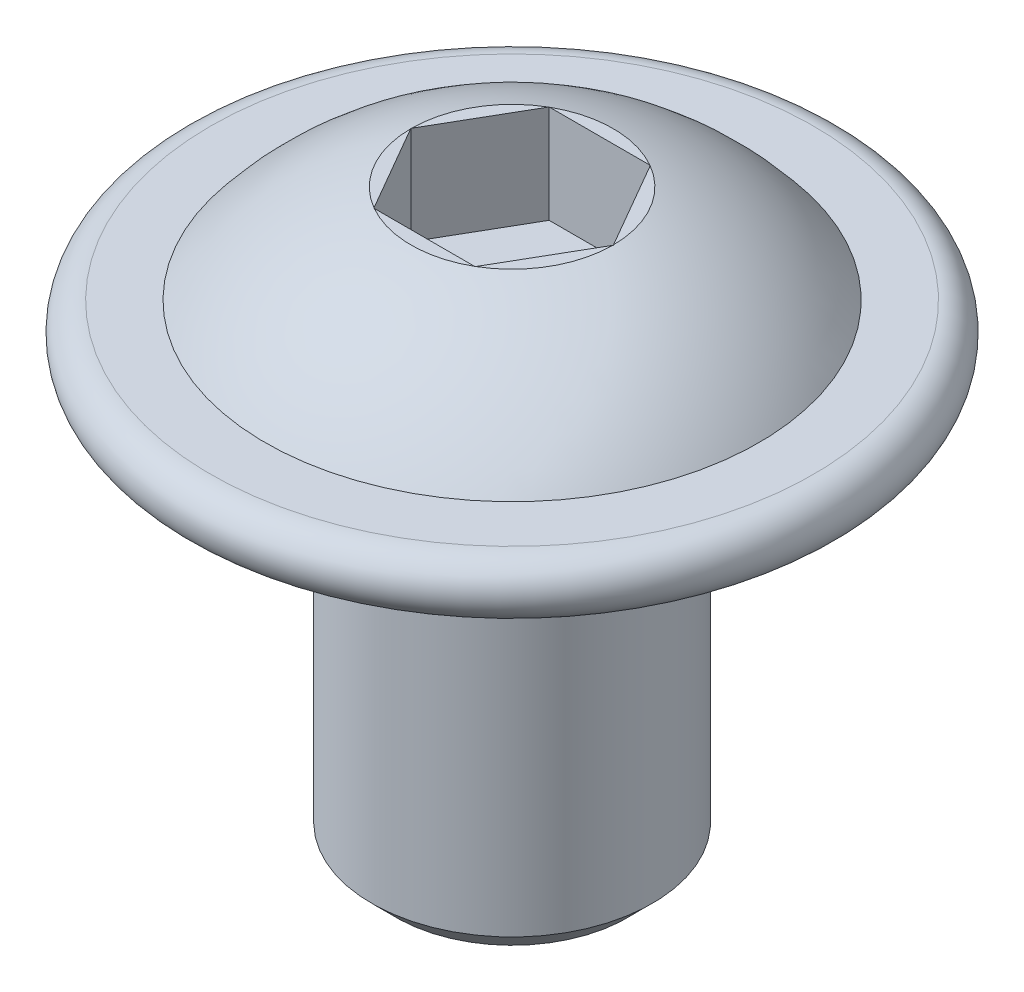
ISO-10303-21;
HEADER;
FILE_DESCRIPTION(('STEP AP214'),'2;1');
FILE_NAME('part.step','',(''),(''),'','','');
FILE_SCHEMA(('AUTOMOTIVE_DESIGN { 1 0 10303 214 1 1 1 1 }'));
ENDSEC;
DATA;
#1=APPLICATION_CONTEXT('core data for automotive mechanical design processes');
#2=APPLICATION_PROTOCOL_DEFINITION('international standard','automotive_design',2000,#1);
#3=PRODUCT_CONTEXT('',#1,'mechanical');
#4=PRODUCT('Part','Part','',(#3));
#5=PRODUCT_RELATED_PRODUCT_CATEGORY('part','',(#4));
#6=PRODUCT_DEFINITION_FORMATION('','',#4);
#7=PRODUCT_DEFINITION_CONTEXT('part definition',#1,'design');
#8=PRODUCT_DEFINITION('design','',#6,#7);
#9=PRODUCT_DEFINITION_SHAPE('','',#8);
#10=(LENGTH_UNIT() NAMED_UNIT(*) SI_UNIT(.MILLI.,.METRE.));
#11=(NAMED_UNIT(*) PLANE_ANGLE_UNIT() SI_UNIT($,.RADIAN.));
#12=(NAMED_UNIT(*) SI_UNIT($,.STERADIAN.) SOLID_ANGLE_UNIT());
#13=UNCERTAINTY_MEASURE_WITH_UNIT(LENGTH_MEASURE(1.E-05),#10,'distance_accuracy_value','');
#14=(GEOMETRIC_REPRESENTATION_CONTEXT(3) GLOBAL_UNCERTAINTY_ASSIGNED_CONTEXT((#13)) GLOBAL_UNIT_ASSIGNED_CONTEXT((#10,
#11,#12)) REPRESENTATION_CONTEXT('',''));
#15=CARTESIAN_POINT('',(0.,0.,0.));
#16=DIRECTION('',(0.,0.,1.));
#17=DIRECTION('',(1.,0.,0.));
#18=AXIS2_PLACEMENT_3D('',#15,#16,#17);
#19=CARTESIAN_POINT('',(0.,2.2,0.));
#20=DIRECTION('',(0.,-1.,0.));
#21=DIRECTION('',(1.,0.,0.));
#22=AXIS2_PLACEMENT_3D('',#19,#20,#21);
#23=PLANE('',#22);
#24=CARTESIAN_POINT('',(0.,2.2,0.));
#25=DIRECTION('',(0.,1.,0.));
#26=DIRECTION('',(-1.,0.,0.));
#27=AXIS2_PLACEMENT_3D('',#24,#25,#26);
#28=CIRCLE('',#27,1.44);
#29=CARTESIAN_POINT('',(1.43998804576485,2.2,-0.00586754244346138));
#30=VERTEX_POINT('',#29);
#31=CARTESIAN_POINT('',(0.725075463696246,2.2,-1.24413245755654));
#32=VERTEX_POINT('',#31);
#33=EDGE_CURVE('E295',#30,#32,#28,.T.);
#34=ORIENTED_EDGE('',*,*,#33,.T.);
#35=DIRECTION('',(0.5,0.,0.866025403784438));
#36=VECTOR('',#35,1.);
#37=CARTESIAN_POINT('',(1.08253175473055,2.2,-0.625));
#38=LINE('',#37,#36);
#39=EDGE_CURVE('E11',#32,#30,#38,.T.);
#40=ORIENTED_EDGE('',*,*,#39,.T.);
#41=EDGE_LOOP('',(#34,#40));
#42=FACE_BOUND('',#41,.T.);
#43=ADVANCED_FACE('F36',(#42),#23,.F.);
#44=CARTESIAN_POINT('',(0.714912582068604,2.2,-1.25));
#45=VERTEX_POINT('',#44);
#46=CARTESIAN_POINT('',(-0.714912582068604,2.2,-1.25));
#47=VERTEX_POINT('',#46);
#48=EDGE_CURVE('E292',#45,#47,#28,.T.);
#49=ORIENTED_EDGE('',*,*,#48,.T.);
#50=DIRECTION('',(1.,0.,0.));
#51=VECTOR('',#50,1.);
#52=CARTESIAN_POINT('',(0.,2.2,-1.25));
#53=LINE('',#52,#51);
#54=EDGE_CURVE('E44',#47,#45,#53,.T.);
#55=ORIENTED_EDGE('',*,*,#54,.T.);
#56=EDGE_LOOP('',(#49,#55));
#57=FACE_BOUND('',#56,.T.);
#58=ADVANCED_FACE('F291',(#57),#23,.F.);
#59=CARTESIAN_POINT('',(-0.725075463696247,2.2,-1.24413245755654));
#60=VERTEX_POINT('',#59);
#61=CARTESIAN_POINT('',(-1.43998804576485,2.2,-0.00586754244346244));
#62=VERTEX_POINT('',#61);
#63=EDGE_CURVE('E251',#60,#62,#28,.T.);
#64=ORIENTED_EDGE('',*,*,#63,.T.);
#65=DIRECTION('',(0.5,0.,-0.866025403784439));
#66=VECTOR('',#65,1.);
#67=CARTESIAN_POINT('',(-1.08253175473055,2.2,-0.625));
#68=LINE('',#67,#66);
#69=EDGE_CURVE('E285',#62,#60,#68,.T.);
#70=ORIENTED_EDGE('',*,*,#69,.T.);
#71=EDGE_LOOP('',(#64,#70));
#72=FACE_BOUND('',#71,.T.);
#73=ADVANCED_FACE('F301',(#72),#23,.F.);
#74=CARTESIAN_POINT('',(-1.43998804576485,2.2,0.00586754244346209));
#75=VERTEX_POINT('',#74);
#76=CARTESIAN_POINT('',(-0.725075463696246,2.2,1.24413245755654));
#77=VERTEX_POINT('',#76);
#78=EDGE_CURVE('E252',#75,#77,#28,.T.);
#79=ORIENTED_EDGE('',*,*,#78,.T.);
#80=DIRECTION('',(-0.5,0.,-0.866025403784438));
#81=VECTOR('',#80,1.);
#82=CARTESIAN_POINT('',(-1.08253175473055,2.2,0.625000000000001));
#83=LINE('',#82,#81);
#84=EDGE_CURVE('E282',#77,#75,#83,.T.);
#85=ORIENTED_EDGE('',*,*,#84,.T.);
#86=EDGE_LOOP('',(#79,#85));
#87=FACE_BOUND('',#86,.T.);
#88=ADVANCED_FACE('F318',(#87),#23,.F.);
#89=CARTESIAN_POINT('',(-0.714912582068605,2.2,1.25));
#90=VERTEX_POINT('',#89);
#91=CARTESIAN_POINT('',(0.714912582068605,2.2,1.25));
#92=VERTEX_POINT('',#91);
#93=EDGE_CURVE('E256',#90,#92,#28,.T.);
#94=ORIENTED_EDGE('',*,*,#93,.T.);
#95=DIRECTION('',(-1.,0.,0.));
#96=VECTOR('',#95,1.);
#97=CARTESIAN_POINT('',(0.,2.2,1.25));
#98=LINE('',#97,#96);
#99=EDGE_CURVE('E279',#92,#90,#98,.T.);
#100=ORIENTED_EDGE('',*,*,#99,.T.);
#101=EDGE_LOOP('',(#94,#100));
#102=FACE_BOUND('',#101,.T.);
#103=ADVANCED_FACE('F316',(#102),#23,.F.);
#104=CARTESIAN_POINT('',(1.65,-6.,0.));
#105=DIRECTION('',(0.,1.,0.));
#106=DIRECTION('',(-1.,0.,0.));
#107=AXIS2_PLACEMENT_3D('',#104,#105,#106);
#108=PLANE('',#107);
#109=CARTESIAN_POINT('',(0.,-6.,0.));
#110=DIRECTION('',(0.,1.,0.));
#111=DIRECTION('',(-1.,0.,0.));
#112=AXIS2_PLACEMENT_3D('',#109,#110,#111);
#113=CIRCLE('',#112,1.65);
#114=CARTESIAN_POINT('',(-1.65,-6.,0.));
#115=VERTEX_POINT('',#114);
#116=EDGE_CURVE('E274',#115,#115,#113,.T.);
#117=ORIENTED_EDGE('',*,*,#116,.F.);
#118=EDGE_LOOP('',(#117));
#119=FACE_BOUND('',#118,.T.);
#120=ADVANCED_FACE('F38',(#119),#108,.F.);
#121=CARTESIAN_POINT('',(0.,-6.,0.));
#122=DIRECTION('',(0.,1.,0.));
#123=DIRECTION('',(-1.,0.,0.));
#124=AXIS2_PLACEMENT_3D('',#121,#122,#123);
#125=CONICAL_SURFACE('',#124,1.65,0.785398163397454);
#126=CARTESIAN_POINT('',(0.,-5.65,0.));
#127=DIRECTION('',(0.,1.,0.));
#128=DIRECTION('',(-1.,0.,0.));
#129=AXIS2_PLACEMENT_3D('',#126,#127,#128);
#130=CIRCLE('',#129,2.);
#131=CARTESIAN_POINT('',(-2.,-5.65,0.));
#132=VERTEX_POINT('',#131);
#133=EDGE_CURVE('E271',#132,#132,#130,.T.);
#134=ORIENTED_EDGE('',*,*,#133,.F.);
#135=EDGE_LOOP('',(#134));
#136=FACE_BOUND('',#135,.T.);
#137=ORIENTED_EDGE('',*,*,#116,.T.);
#138=EDGE_LOOP('',(#137));
#139=FACE_BOUND('',#138,.T.);
#140=ADVANCED_FACE('F359',(#136,#139),#125,.T.);
#141=CARTESIAN_POINT('',(0.,2.2,0.));
#142=DIRECTION('',(0.,1.,0.));
#143=DIRECTION('',(-1.,0.,0.));
#144=AXIS2_PLACEMENT_3D('',#141,#142,#143);
#145=CYLINDRICAL_SURFACE('',#144,2.);
#146=CARTESIAN_POINT('',(0.,-0.200000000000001,0.));
#147=DIRECTION('',(0.,1.,0.));
#148=DIRECTION('',(-1.,0.,0.));
#149=AXIS2_PLACEMENT_3D('',#146,#147,#148);
#150=CIRCLE('',#149,2.);
#151=CARTESIAN_POINT('',(-2.,-0.200000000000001,0.));
#152=VERTEX_POINT('',#151);
#153=EDGE_CURVE('E268',#152,#152,#150,.T.);
#154=ORIENTED_EDGE('',*,*,#153,.F.);
#155=EDGE_LOOP('',(#154));
#156=FACE_BOUND('',#155,.T.);
#157=ORIENTED_EDGE('',*,*,#133,.T.);
#158=EDGE_LOOP('',(#157));
#159=FACE_BOUND('',#158,.T.);
#160=ADVANCED_FACE('F356',(#156,#159),#145,.T.);
#161=CARTESIAN_POINT('',(0.,-0.2,0.));
#162=DIRECTION('',(0.,1.,0.));
#163=DIRECTION('',(-1.,0.,0.));
#164=AXIS2_PLACEMENT_3D('',#161,#162,#163);
#165=TOROIDAL_SURFACE('',#164,2.2,0.2);
#166=CARTESIAN_POINT('',(0.,0.,0.));
#167=DIRECTION('',(0.,1.,0.));
#168=DIRECTION('',(-1.,0.,0.));
#169=AXIS2_PLACEMENT_3D('',#166,#167,#168);
#170=CIRCLE('',#169,2.2);
#171=CARTESIAN_POINT('',(-2.2,0.,0.));
#172=VERTEX_POINT('',#171);
#173=EDGE_CURVE('E265',#172,#172,#170,.T.);
#174=ORIENTED_EDGE('',*,*,#173,.F.);
#175=EDGE_LOOP('',(#174));
#176=FACE_BOUND('',#175,.T.);
#177=ORIENTED_EDGE('',*,*,#153,.T.);
#178=EDGE_LOOP('',(#177));
#179=FACE_BOUND('',#178,.T.);
#180=ADVANCED_FACE('F352',(#176,#179),#165,.F.);
#181=CARTESIAN_POINT('',(4.3,0.,0.));
#182=DIRECTION('',(0.,1.,0.));
#183=DIRECTION('',(-1.,0.,0.));
#184=AXIS2_PLACEMENT_3D('',#181,#182,#183);
#185=PLANE('',#184);
#186=CARTESIAN_POINT('',(0.,0.,0.));
#187=DIRECTION('',(0.,1.,0.));
#188=DIRECTION('',(-1.,0.,0.));
#189=AXIS2_PLACEMENT_3D('',#186,#187,#188);
#190=CIRCLE('',#189,4.3);
#191=CARTESIAN_POINT('',(-4.3,0.,0.));
#192=VERTEX_POINT('',#191);
#193=EDGE_CURVE('E262',#192,#192,#190,.T.);
#194=ORIENTED_EDGE('',*,*,#193,.F.);
#195=EDGE_LOOP('',(#194));
#196=FACE_BOUND('',#195,.T.);
#197=ORIENTED_EDGE('',*,*,#173,.T.);
#198=EDGE_LOOP('',(#197));
#199=FACE_BOUND('',#198,.T.);
#200=ADVANCED_FACE('F344',(#196,#199),#185,.F.);
#201=CARTESIAN_POINT('',(0.,0.399999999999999,0.));
#202=DIRECTION('',(0.,1.,0.));
#203=DIRECTION('',(-1.,0.,0.));
#204=AXIS2_PLACEMENT_3D('',#201,#202,#203);
#205=TOROIDAL_SURFACE('',#204,4.3,0.4);
#206=CARTESIAN_POINT('',(0.,0.799999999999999,0.));
#207=DIRECTION('',(0.,1.,0.));
#208=DIRECTION('',(-1.,0.,0.));
#209=AXIS2_PLACEMENT_3D('',#206,#207,#208);
#210=CIRCLE('',#209,4.3);
#211=CARTESIAN_POINT('',(-4.3,0.799999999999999,0.));
#212=VERTEX_POINT('',#211);
#213=EDGE_CURVE('E259',#212,#212,#210,.T.);
#214=ORIENTED_EDGE('',*,*,#213,.F.);
#215=EDGE_LOOP('',(#214));
#216=FACE_BOUND('',#215,.T.);
#217=ORIENTED_EDGE('',*,*,#193,.T.);
#218=EDGE_LOOP('',(#217));
#219=FACE_BOUND('',#218,.T.);
#220=ADVANCED_FACE('F339',(#216,#219),#205,.T.);
#221=CARTESIAN_POINT('',(4.3,0.8,0.));
#222=DIRECTION('',(0.,-1.,0.));
#223=DIRECTION('',(1.,0.,0.));
#224=AXIS2_PLACEMENT_3D('',#221,#222,#223);
#225=PLANE('',#224);
#226=CARTESIAN_POINT('',(0.,0.799999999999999,0.));
#227=DIRECTION('',(0.,1.,0.));
#228=DIRECTION('',(-1.,0.,0.));
#229=AXIS2_PLACEMENT_3D('',#226,#227,#228);
#230=CIRCLE('',#229,3.52);
#231=CARTESIAN_POINT('',(-3.52,0.799999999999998,0.));
#232=VERTEX_POINT('',#231);
#233=EDGE_CURVE('E255',#232,#232,#230,.T.);
#234=ORIENTED_EDGE('',*,*,#233,.F.);
#235=EDGE_LOOP('',(#234));
#236=FACE_BOUND('',#235,.T.);
#237=ORIENTED_EDGE('',*,*,#213,.T.);
#238=EDGE_LOOP('',(#237));
#239=FACE_BOUND('',#238,.T.);
#240=ADVANCED_FACE('F335',(#236,#239),#225,.F.);
#241=CARTESIAN_POINT('',(0.,-1.73841135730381,0.));
#242=DIRECTION('',(0.,1.,0.));
#243=DIRECTION('',(-1.,0.,0.));
#244=AXIS2_PLACEMENT_3D('',#241,#242,#243);
#245=DEGENERATE_TOROIDAL_SURFACE('',#244,0.300300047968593,4.1,.T.);
#246=CARTESIAN_POINT('',(0.,2.25008083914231,-1.25));
#247=CARTESIAN_POINT('',(0.106899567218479,2.25008013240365,-1.25));
#248=CARTESIAN_POINT('',(0.213796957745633,2.2468328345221,-1.25));
#249=CARTESIAN_POINT('',(0.427173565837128,2.23364091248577,-1.25));
#250=CARTESIAN_POINT('',(0.533652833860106,2.22369712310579,-1.25));
#251=CARTESIAN_POINT('',(0.745560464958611,2.19670680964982,-1.25));
#252=CARTESIAN_POINT('',(0.850990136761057,2.17967069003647,-1.25));
#253=CARTESIAN_POINT('',(1.06037444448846,2.13812562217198,-1.25));
#254=CARTESIAN_POINT('',(1.16432908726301,2.11361670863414,-1.25));
#255=CARTESIAN_POINT('',(1.37064720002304,2.05677380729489,-1.25));
#256=CARTESIAN_POINT('',(1.47300019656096,2.02440154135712,-1.25));
#257=CARTESIAN_POINT('',(1.67491538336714,1.95186760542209,-1.25));
#258=CARTESIAN_POINT('',(1.7744768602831,1.91170396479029,-1.25));
#259=CARTESIAN_POINT('',(2.06804847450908,1.7795872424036,-1.25));
#260=CARTESIAN_POINT('',(2.25698460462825,1.67599778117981,-1.25));
#261=CARTESIAN_POINT('',(2.62985038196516,1.43064517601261,-1.25));
#262=CARTESIAN_POINT('',(2.81223148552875,1.28652927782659,-1.25));
#263=CARTESIAN_POINT('',(3.14914356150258,0.96868791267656,-1.25));
#264=CARTESIAN_POINT('',(3.30367127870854,0.794958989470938,-1.25));
#265=CARTESIAN_POINT('',(3.57508001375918,0.429671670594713,-1.25));
#266=CARTESIAN_POINT('',(3.6930898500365,0.238950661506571,-1.25));
#267=CARTESIAN_POINT('',(3.8950920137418,-0.159701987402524,-1.25));
#268=CARTESIAN_POINT('',(3.97909018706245,-0.36763066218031,-1.25));
#269=CARTESIAN_POINT('',(4.11006304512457,-0.792936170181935,-1.25));
#270=CARTESIAN_POINT('',(4.15733987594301,-1.01022002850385,-1.25));
#271=CARTESIAN_POINT('',(4.21465722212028,-1.44965365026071,-1.25));
#272=CARTESIAN_POINT('',(4.22469693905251,-1.67180351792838,-1.25));
#273=CARTESIAN_POINT('',(4.20726656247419,-2.1141351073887,-1.25));
#274=CARTESIAN_POINT('',(4.1798785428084,-2.33432007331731,-1.25));
#275=CARTESIAN_POINT('',(4.08852455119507,-2.76695873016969,-1.25));
#276=CARTESIAN_POINT('',(4.02456090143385,-2.97941291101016,-1.25));
#277=CARTESIAN_POINT('',(3.86192535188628,-3.39058169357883,-1.25));
#278=CARTESIAN_POINT('',(3.76324997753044,-3.58929491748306,-1.25));
#279=CARTESIAN_POINT('',(3.5339148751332,-3.96749884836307,-1.25));
#280=CARTESIAN_POINT('',(3.40324999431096,-4.1469864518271,-1.25));
#281=CARTESIAN_POINT('',(3.18613300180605,-4.39806661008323,-1.25));
#282=CARTESIAN_POINT('',(3.11007518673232,-4.47887161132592,-1.25));
#283=CARTESIAN_POINT('',(2.9514690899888,-4.6338231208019,-1.25));
#284=CARTESIAN_POINT('',(2.8689231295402,-4.70797199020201,-1.25));
#285=CARTESIAN_POINT('',(2.69794306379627,-4.84911014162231,-1.25));
#286=CARTESIAN_POINT('',(2.60950938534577,-4.9160999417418,-1.25));
#287=CARTESIAN_POINT('',(2.42741777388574,-5.04248647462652,-1.25));
#288=CARTESIAN_POINT('',(2.33376163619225,-5.10188579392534,-1.25));
#289=CARTESIAN_POINT('',(2.14094127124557,-5.21330849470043,-1.25));
#290=CARTESIAN_POINT('',(2.04173224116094,-5.26525430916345,-1.25));
#291=CARTESIAN_POINT('',(1.83941459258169,-5.36079768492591,-1.25));
#292=CARTESIAN_POINT('',(1.73630719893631,-5.40439784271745,-1.25));
#293=CARTESIAN_POINT('',(1.52687229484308,-5.48314573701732,-1.25));
#294=CARTESIAN_POINT('',(1.42054352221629,-5.51829011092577,-1.25));
#295=CARTESIAN_POINT('',(1.20546532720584,-5.58011940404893,-1.25));
#296=CARTESIAN_POINT('',(1.09671594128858,-5.60680445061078,-1.25));
#297=CARTESIAN_POINT('',(0.872689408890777,-5.65292329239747,-1.25));
#298=CARTESIAN_POINT('',(0.757336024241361,-5.67198497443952,-1.25));
#299=CARTESIAN_POINT('',(0.525544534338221,-5.70159667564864,-1.25));
#300=CARTESIAN_POINT('',(0.40910629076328,-5.71214559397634,-1.25));
#301=CARTESIAN_POINT('',(0.175605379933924,-5.72529480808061,-1.25));
#302=CARTESIAN_POINT('',(0.0585420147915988,-5.7278824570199,-1.25));
#303=CARTESIAN_POINT('',(-0.175507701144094,-5.72527299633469,-1.25));
#304=CARTESIAN_POINT('',(-0.292494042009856,-5.72007502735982,-1.25));
#305=CARTESIAN_POINT('',(-0.549164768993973,-5.6996646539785,-1.25));
#306=CARTESIAN_POINT('',(-0.688714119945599,-5.68265886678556,-1.25));
#307=CARTESIAN_POINT('',(-0.965687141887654,-5.63592651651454,-1.25));
#308=CARTESIAN_POINT('',(-1.10311091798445,-5.60620058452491,-1.25));
#309=CARTESIAN_POINT('',(-1.37413120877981,-5.53352948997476,-1.25));
#310=CARTESIAN_POINT('',(-1.50773514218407,-5.49061216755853,-1.25));
#311=CARTESIAN_POINT('',(-1.76992206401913,-5.39147243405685,-1.25));
#312=CARTESIAN_POINT('',(-1.89850542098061,-5.33525100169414,-1.25));
#313=CARTESIAN_POINT('',(-2.13442403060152,-5.21720963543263,-1.25));
#314=CARTESIAN_POINT('',(-2.24247988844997,-5.15682539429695,-1.25));
#315=CARTESIAN_POINT('',(-2.45256426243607,-5.02635350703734,-1.25));
#316=CARTESIAN_POINT('',(-2.55459322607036,-4.95626658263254,-1.25));
#317=CARTESIAN_POINT('',(-2.75177023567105,-4.80687258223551,-1.25));
#318=CARTESIAN_POINT('',(-2.84691357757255,-4.72755929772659,-1.25));
#319=CARTESIAN_POINT('',(-3.0293805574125,-4.56039892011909,-1.25));
#320=CARTESIAN_POINT('',(-3.1167046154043,-4.4725522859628,-1.25));
#321=CARTESIAN_POINT('',(-3.275184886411,-4.29742358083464,-1.25));
#322=CARTESIAN_POINT('',(-3.34708923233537,-4.21081701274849,-1.25));
#323=CARTESIAN_POINT('',(-3.48327292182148,-4.03175492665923,-1.25));
#324=CARTESIAN_POINT('',(-3.54754967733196,-3.93929743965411,-1.25));
#325=CARTESIAN_POINT('',(-3.66791090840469,-3.74930837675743,-1.25));
#326=CARTESIAN_POINT('',(-3.72400299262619,-3.65178162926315,-1.25));
#327=CARTESIAN_POINT('',(-3.8276589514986,-3.45228448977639,-1.25));
#328=CARTESIAN_POINT('',(-3.87521969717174,-3.35031248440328,-1.25));
#329=CARTESIAN_POINT('',(-4.00335246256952,-3.04163876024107,-1.25));
#330=CARTESIAN_POINT('',(-4.07110673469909,-2.82943421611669,-1.25));
#331=CARTESIAN_POINT('',(-4.16986443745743,-2.39673261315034,-1.25));
#332=CARTESIAN_POINT('',(-4.20086410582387,-2.17623470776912,-1.25));
#333=CARTESIAN_POINT('',(-4.22523072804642,-1.73386512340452,-1.25));
#334=CARTESIAN_POINT('',(-4.21872043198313,-1.51200029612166,-1.25));
#335=CARTESIAN_POINT('',(-4.16852566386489,-1.0725353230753,-1.25));
#336=CARTESIAN_POINT('',(-4.12484282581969,-0.854934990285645,-1.25));
#337=CARTESIAN_POINT('',(-4.00158888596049,-0.430236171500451,-1.25));
#338=CARTESIAN_POINT('',(-3.92203236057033,-0.223133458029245,-1.25));
#339=CARTESIAN_POINT('',(-3.72936116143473,0.1747901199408,-1.25));
#340=CARTESIAN_POINT('',(-3.61624593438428,0.365610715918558,-1.25));
#341=CARTESIAN_POINT('',(-3.35937977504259,0.726036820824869,-1.25));
#342=CARTESIAN_POINT('',(-3.21557486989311,0.895604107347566,-1.25));
#343=CARTESIAN_POINT('',(-2.98035364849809,1.13005842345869,-1.25));
#344=CARTESIAN_POINT('',(-2.89864576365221,1.20492816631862,-1.25));
#345=CARTESIAN_POINT('',(-2.7292818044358,1.34759034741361,-1.25));
#346=CARTESIAN_POINT('',(-2.64162782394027,1.41538525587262,-1.25));
#347=CARTESIAN_POINT('',(-2.46036149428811,1.54391619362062,-1.25));
#348=CARTESIAN_POINT('',(-2.36671126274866,1.60459869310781,-1.25));
#349=CARTESIAN_POINT('',(-2.17473246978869,1.71796747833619,-1.25));
#350=CARTESIAN_POINT('',(-2.07640547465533,1.77065641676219,-1.25));
#351=CARTESIAN_POINT('',(-1.87578191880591,1.86778081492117,-1.25));
#352=CARTESIAN_POINT('',(-1.77348606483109,1.91221773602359,-1.25));
#353=CARTESIAN_POINT('',(-1.56567905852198,1.99268444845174,-1.25));
#354=CARTESIAN_POINT('',(-1.46016883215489,2.02871663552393,-1.25));
#355=CARTESIAN_POINT('',(-1.24396608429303,2.09318500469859,-1.25));
#356=CARTESIAN_POINT('',(-1.13320996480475,2.12140742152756,-1.25));
#357=CARTESIAN_POINT('',(-0.909858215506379,2.16922742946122,-1.25));
#358=CARTESIAN_POINT('',(-0.797262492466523,2.18882458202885,-1.25));
#359=CARTESIAN_POINT('',(-0.570810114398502,2.21983890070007,-1.25));
#360=CARTESIAN_POINT('',(-0.456951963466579,2.23124499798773,-1.25));
#361=CARTESIAN_POINT('',(-0.228728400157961,2.24636660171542,-1.25));
#362=CARTESIAN_POINT('',(-0.114362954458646,2.25008159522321,-1.25));
#363=CARTESIAN_POINT('',(0.,2.25008083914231,-1.25));
#364=B_SPLINE_CURVE_WITH_KNOTS('',3,(#246,#247,#248,#249,#250,#251,#252,#253,#254,#255,#256,
#257,#258,#259,#260,#261,#262,#263,#264,#265,#266,#267,#268,#269,#270,#271,#272,#273,#274,#275,
#276,#277,#278,#279,#280,#281,#282,#283,#284,#285,#286,#287,#288,#289,#290,#291,#292,#293,#294,
#295,#296,#297,#298,#299,#300,#301,#302,#303,#304,#305,#306,#307,#308,#309,#310,#311,#312,#313,
#314,#315,#316,#317,#318,#319,#320,#321,#322,#323,#324,#325,#326,#327,#328,#329,#330,#331,#332,
#333,#334,#335,#336,#337,#338,#339,#340,#341,#342,#343,#344,#345,#346,#347,#348,#349,#350,#351,
#352,#353,#354,#355,#356,#357,#358,#359,#360,#361,#362,#363),.UNSPECIFIED.,.T.,.F.,(4,2,2,2,2,2,
2,2,2,2,2,2,2,2,2,2,2,2,2,2,2,2,2,2,2,2,2,2,2,2,2,2,2,2,2,2,2,2,2,2,2,2,2,2,2,2,2,2,2,2,2,2,2,2,
2,2,2,2,4),(0.,0.320643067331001,0.641246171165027,0.961380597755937,1.28151353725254,
1.60323723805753,1.9250424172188,2.56853342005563,3.26237607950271,3.95629977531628,
4.6259237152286,5.29543251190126,5.95937240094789,6.62332652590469,7.28582702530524,
7.94828546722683,8.61081023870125,9.27344179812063,9.60603008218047,9.93849991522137,
10.2709456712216,10.6032778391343,10.9388504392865,11.274318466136,11.6099196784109,
11.9455158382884,12.2959270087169,12.646383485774,12.9973963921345,13.348448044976,
13.7696398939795,14.1908108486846,14.6110989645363,15.0313561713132,15.4021960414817,
15.7730083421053,16.1440716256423,16.5151149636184,16.8524073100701,17.1898137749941,
17.5269045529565,17.8641187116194,18.5289352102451,19.1938197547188,19.8565297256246,
20.5192105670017,21.1816223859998,21.8440451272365,22.5076425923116,22.8397936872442,
23.1718284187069,23.5062203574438,23.8405010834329,24.1747225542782,24.5088486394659,
24.851375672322,25.1939201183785,25.5369265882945,25.8799559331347),.UNSPECIFIED.);
#365=CARTESIAN_POINT('',(0.721687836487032,2.19902157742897,-1.25));
#366=VERTEX_POINT('',#365);
#367=EDGE_CURVE('E240',#45,#366,#364,.T.);
#368=ORIENTED_EDGE('',*,*,#367,.T.);
#369=CARTESIAN_POINT('',(0.721572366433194,2.19898804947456,-1.2502));
#370=CARTESIAN_POINT('',(0.722272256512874,2.19919130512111,-1.24898775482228));
#371=CARTESIAN_POINT('',(0.72297219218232,2.19939392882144,-1.24777543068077));
#372=CARTESIAN_POINT('',(0.72437215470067,2.1997979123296,-1.2453506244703));
#373=CARTESIAN_POINT('',(0.725072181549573,2.19999927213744,-1.24413814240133));
#374=CARTESIAN_POINT('',(0.725772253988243,2.20019999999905,-1.24292558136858));
#375=B_SPLINE_CURVE_WITH_KNOTS('',3,(#369,#370,#371,#372,#373,#374),.UNSPECIFIED.,.F.,.F.,(4,2,
4),(0.,0.00424337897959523,0.0084867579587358),.UNSPECIFIED.);
#376=EDGE_CURVE('E140',#366,#32,#375,.T.);
#377=ORIENTED_EDGE('',*,*,#376,.T.);
#378=ORIENTED_EDGE('',*,*,#33,.F.);
#379=CARTESIAN_POINT('',(1.43929125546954,2.2002,-0.00707441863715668));
#380=CARTESIAN_POINT('',(1.43999132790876,2.19999927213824,-0.00586185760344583));
#381=CARTESIAN_POINT('',(1.44069135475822,2.19979791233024,-0.00464937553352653));
#382=CARTESIAN_POINT('',(1.44209131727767,2.19939392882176,-0.00222456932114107));
#383=CARTESIAN_POINT('',(1.44279125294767,2.19919130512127,-0.00101224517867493));
#384=CARTESIAN_POINT('',(1.4434911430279,2.19898804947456,0.000199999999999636));
#385=B_SPLINE_CURVE_WITH_KNOTS('',3,(#379,#380,#381,#382,#383,#384),.UNSPECIFIED.,.F.,.F.,(4,2,
4),(0.,0.00424337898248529,0.00848675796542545),.UNSPECIFIED.);
#386=CARTESIAN_POINT('',(1.44337567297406,2.19902157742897,0.));
#387=VERTEX_POINT('',#386);
#388=EDGE_CURVE('E241',#30,#387,#385,.T.);
#389=ORIENTED_EDGE('',*,*,#388,.T.);
#390=CARTESIAN_POINT('',(1.4434911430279,2.19898804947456,-0.000200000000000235));
#391=CARTESIAN_POINT('',(1.44279125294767,2.19919130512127,0.00101224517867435));
#392=CARTESIAN_POINT('',(1.44209131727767,2.19939392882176,0.00222456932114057));
#393=CARTESIAN_POINT('',(1.44069135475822,2.19979791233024,0.00464937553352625));
#394=CARTESIAN_POINT('',(1.43999132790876,2.19999927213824,0.00586185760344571));
#395=CARTESIAN_POINT('',(1.43929125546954,2.2002,0.00707441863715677));
#396=B_SPLINE_CURVE_WITH_KNOTS('',3,(#390,#391,#392,#393,#394,#395),.UNSPECIFIED.,.F.,.F.,(4,2,
4),(0.,0.00424337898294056,0.00848675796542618),.UNSPECIFIED.);
#397=CARTESIAN_POINT('',(1.43998804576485,2.2,0.00586754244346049));
#398=VERTEX_POINT('',#397);
#399=EDGE_CURVE('E173',#387,#398,#396,.T.);
#400=ORIENTED_EDGE('',*,*,#399,.T.);
#401=CARTESIAN_POINT('',(0.725075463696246,2.2,1.24413245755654));
#402=VERTEX_POINT('',#401);
#403=EDGE_CURVE('E297',#402,#398,#28,.T.);
#404=ORIENTED_EDGE('',*,*,#403,.F.);
#405=CARTESIAN_POINT('',(0.725772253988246,2.20019999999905,1.24292558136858));
#406=CARTESIAN_POINT('',(0.725072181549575,2.19999927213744,1.24413814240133));
#407=CARTESIAN_POINT('',(0.724372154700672,2.1997979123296,1.24535062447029));
#408=CARTESIAN_POINT('',(0.722972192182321,2.19939392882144,1.24777543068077));
#409=CARTESIAN_POINT('',(0.722272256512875,2.19919130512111,1.24898775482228));
#410=CARTESIAN_POINT('',(0.721572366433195,2.19898804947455,1.2502));
#411=B_SPLINE_CURVE_WITH_KNOTS('',3,(#405,#406,#407,#408,#409,#410),.UNSPECIFIED.,.F.,.F.,(4,2,
4),(0.,0.00424337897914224,0.00848675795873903),.UNSPECIFIED.);
#412=CARTESIAN_POINT('',(0.721687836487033,2.19902157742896,1.25));
#413=VERTEX_POINT('',#412);
#414=EDGE_CURVE('E51',#402,#413,#411,.T.);
#415=ORIENTED_EDGE('',*,*,#414,.T.);
#416=CARTESIAN_POINT('',(0.,2.25008083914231,1.25));
#417=CARTESIAN_POINT('',(-0.106899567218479,2.25008013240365,1.25));
#418=CARTESIAN_POINT('',(-0.213796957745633,2.2468328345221,1.25));
#419=CARTESIAN_POINT('',(-0.427173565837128,2.23364091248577,1.25));
#420=CARTESIAN_POINT('',(-0.533652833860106,2.22369712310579,1.25));
#421=CARTESIAN_POINT('',(-0.745560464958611,2.19670680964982,1.25));
#422=CARTESIAN_POINT('',(-0.850990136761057,2.17967069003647,1.25));
#423=CARTESIAN_POINT('',(-1.06037444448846,2.13812562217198,1.25));
#424=CARTESIAN_POINT('',(-1.16432908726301,2.11361670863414,1.25));
#425=CARTESIAN_POINT('',(-1.37064720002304,2.05677380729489,1.25));
#426=CARTESIAN_POINT('',(-1.47300019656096,2.02440154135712,1.25));
#427=CARTESIAN_POINT('',(-1.67491538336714,1.95186760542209,1.25));
#428=CARTESIAN_POINT('',(-1.7744768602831,1.91170396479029,1.25));
#429=CARTESIAN_POINT('',(-2.06804847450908,1.77958724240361,1.25));
#430=CARTESIAN_POINT('',(-2.25698460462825,1.67599778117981,1.25));
#431=CARTESIAN_POINT('',(-2.62985038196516,1.43064517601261,1.25));
#432=CARTESIAN_POINT('',(-2.81223148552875,1.28652927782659,1.25));
#433=CARTESIAN_POINT('',(-3.14914356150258,0.968687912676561,1.25));
#434=CARTESIAN_POINT('',(-3.30367127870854,0.794958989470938,1.25));
#435=CARTESIAN_POINT('',(-3.57508001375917,0.429671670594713,1.25));
#436=CARTESIAN_POINT('',(-3.6930898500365,0.238950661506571,1.25));
#437=CARTESIAN_POINT('',(-3.8950920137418,-0.159701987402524,1.25));
#438=CARTESIAN_POINT('',(-3.97909018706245,-0.36763066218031,1.25));
#439=CARTESIAN_POINT('',(-4.11006304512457,-0.792936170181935,1.25));
#440=CARTESIAN_POINT('',(-4.15733987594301,-1.01022002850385,1.25));
#441=CARTESIAN_POINT('',(-4.21465722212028,-1.44965365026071,1.25));
#442=CARTESIAN_POINT('',(-4.22469693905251,-1.67180351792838,1.25));
#443=CARTESIAN_POINT('',(-4.20726656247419,-2.1141351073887,1.25));
#444=CARTESIAN_POINT('',(-4.1798785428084,-2.33432007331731,1.25));
#445=CARTESIAN_POINT('',(-4.08852455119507,-2.76695873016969,1.25));
#446=CARTESIAN_POINT('',(-4.02456090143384,-2.97941291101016,1.25));
#447=CARTESIAN_POINT('',(-3.86192535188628,-3.39058169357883,1.25));
#448=CARTESIAN_POINT('',(-3.76324997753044,-3.58929491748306,1.25));
#449=CARTESIAN_POINT('',(-3.53391487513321,-3.96749884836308,1.25));
#450=CARTESIAN_POINT('',(-3.40324999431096,-4.1469864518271,1.25));
#451=CARTESIAN_POINT('',(-3.18613300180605,-4.39806661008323,1.25));
#452=CARTESIAN_POINT('',(-3.11007518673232,-4.47887161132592,1.25));
#453=CARTESIAN_POINT('',(-2.9514690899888,-4.6338231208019,1.25));
#454=CARTESIAN_POINT('',(-2.8689231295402,-4.70797199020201,1.25));
#455=CARTESIAN_POINT('',(-2.69794306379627,-4.84911014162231,1.25));
#456=CARTESIAN_POINT('',(-2.60950938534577,-4.9160999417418,1.25));
#457=CARTESIAN_POINT('',(-2.42741777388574,-5.04248647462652,1.25));
#458=CARTESIAN_POINT('',(-2.33376163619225,-5.10188579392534,1.25));
#459=CARTESIAN_POINT('',(-2.14094127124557,-5.21330849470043,1.25));
#460=CARTESIAN_POINT('',(-2.04173224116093,-5.26525430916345,1.25));
#461=CARTESIAN_POINT('',(-1.83941459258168,-5.36079768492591,1.25));
#462=CARTESIAN_POINT('',(-1.73630719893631,-5.40439784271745,1.25));
#463=CARTESIAN_POINT('',(-1.52687229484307,-5.48314573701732,1.25));
#464=CARTESIAN_POINT('',(-1.42054352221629,-5.51829011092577,1.25));
#465=CARTESIAN_POINT('',(-1.20546532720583,-5.58011940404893,1.25));
#466=CARTESIAN_POINT('',(-1.09671594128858,-5.60680445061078,1.25));
#467=CARTESIAN_POINT('',(-0.872689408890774,-5.65292329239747,1.25));
#468=CARTESIAN_POINT('',(-0.757336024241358,-5.67198497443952,1.25));
#469=CARTESIAN_POINT('',(-0.525544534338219,-5.70159667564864,1.25));
#470=CARTESIAN_POINT('',(-0.409106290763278,-5.71214559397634,1.25));
#471=CARTESIAN_POINT('',(-0.175605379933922,-5.72529480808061,1.25));
#472=CARTESIAN_POINT('',(-0.0585420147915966,-5.7278824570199,1.25));
#473=CARTESIAN_POINT('',(0.175507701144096,-5.72527299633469,1.25));
#474=CARTESIAN_POINT('',(0.292494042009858,-5.72007502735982,1.25));
#475=CARTESIAN_POINT('',(0.549164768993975,-5.6996646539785,1.25));
#476=CARTESIAN_POINT('',(0.688714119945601,-5.68265886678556,1.25));
#477=CARTESIAN_POINT('',(0.965687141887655,-5.63592651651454,1.25));
#478=CARTESIAN_POINT('',(1.10311091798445,-5.60620058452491,1.25));
#479=CARTESIAN_POINT('',(1.37413120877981,-5.53352948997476,1.25));
#480=CARTESIAN_POINT('',(1.50773514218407,-5.49061216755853,1.25));
#481=CARTESIAN_POINT('',(1.76992206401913,-5.39147243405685,1.25));
#482=CARTESIAN_POINT('',(1.89850542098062,-5.33525100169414,1.25));
#483=CARTESIAN_POINT('',(2.13442403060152,-5.21720963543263,1.25));
#484=CARTESIAN_POINT('',(2.24247988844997,-5.15682539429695,1.25));
#485=CARTESIAN_POINT('',(2.45256426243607,-5.02635350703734,1.25));
#486=CARTESIAN_POINT('',(2.55459322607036,-4.95626658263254,1.25));
#487=CARTESIAN_POINT('',(2.75177023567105,-4.80687258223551,1.25));
#488=CARTESIAN_POINT('',(2.84691357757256,-4.72755929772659,1.25));
#489=CARTESIAN_POINT('',(3.02938055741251,-4.56039892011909,1.25));
#490=CARTESIAN_POINT('',(3.1167046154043,-4.4725522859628,1.25));
#491=CARTESIAN_POINT('',(3.275184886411,-4.29742358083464,1.25));
#492=CARTESIAN_POINT('',(3.34708923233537,-4.21081701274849,1.25));
#493=CARTESIAN_POINT('',(3.48327292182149,-4.03175492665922,1.25));
#494=CARTESIAN_POINT('',(3.54754967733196,-3.93929743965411,1.25));
#495=CARTESIAN_POINT('',(3.66791090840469,-3.74930837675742,1.25));
#496=CARTESIAN_POINT('',(3.72400299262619,-3.65178162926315,1.25));
#497=CARTESIAN_POINT('',(3.8276589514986,-3.45228448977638,1.25));
#498=CARTESIAN_POINT('',(3.87521969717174,-3.35031248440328,1.25));
#499=CARTESIAN_POINT('',(4.00335246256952,-3.04163876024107,1.25));
#500=CARTESIAN_POINT('',(4.07110673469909,-2.82943421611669,1.25));
#501=CARTESIAN_POINT('',(4.16986443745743,-2.39673261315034,1.25));
#502=CARTESIAN_POINT('',(4.20086410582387,-2.17623470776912,1.25));
#503=CARTESIAN_POINT('',(4.22523072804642,-1.73386512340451,1.25));
#504=CARTESIAN_POINT('',(4.21872043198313,-1.51200029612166,1.25));
#505=CARTESIAN_POINT('',(4.16852566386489,-1.07253532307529,1.25));
#506=CARTESIAN_POINT('',(4.12484282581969,-0.854934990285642,1.25));
#507=CARTESIAN_POINT('',(4.00158888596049,-0.430236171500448,1.25));
#508=CARTESIAN_POINT('',(3.92203236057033,-0.223133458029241,1.25));
#509=CARTESIAN_POINT('',(3.72936116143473,0.174790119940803,1.25));
#510=CARTESIAN_POINT('',(3.61624593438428,0.365610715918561,1.25));
#511=CARTESIAN_POINT('',(3.35937977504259,0.726036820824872,1.25));
#512=CARTESIAN_POINT('',(3.21557486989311,0.895604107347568,1.25));
#513=CARTESIAN_POINT('',(2.98035364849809,1.1300584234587,1.25));
#514=CARTESIAN_POINT('',(2.89864576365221,1.20492816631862,1.25));
#515=CARTESIAN_POINT('',(2.7292818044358,1.34759034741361,1.25));
#516=CARTESIAN_POINT('',(2.64162782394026,1.41538525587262,1.25));
#517=CARTESIAN_POINT('',(2.4603614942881,1.54391619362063,1.25));
#518=CARTESIAN_POINT('',(2.36671126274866,1.60459869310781,1.25));
#519=CARTESIAN_POINT('',(2.17473246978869,1.71796747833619,1.25));
#520=CARTESIAN_POINT('',(2.07640547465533,1.77065641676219,1.25));
#521=CARTESIAN_POINT('',(1.87578191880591,1.86778081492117,1.25));
#522=CARTESIAN_POINT('',(1.77348606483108,1.9122177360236,1.25));
#523=CARTESIAN_POINT('',(1.56567905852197,1.99268444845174,1.25));
#524=CARTESIAN_POINT('',(1.46016883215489,2.02871663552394,1.25));
#525=CARTESIAN_POINT('',(1.24396608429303,2.0931850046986,1.25));
#526=CARTESIAN_POINT('',(1.13320996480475,2.12140742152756,1.25));
#527=CARTESIAN_POINT('',(0.909858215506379,2.16922742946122,1.25));
#528=CARTESIAN_POINT('',(0.797262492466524,2.18882458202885,1.25));
#529=CARTESIAN_POINT('',(0.570810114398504,2.21983890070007,1.25));
#530=CARTESIAN_POINT('',(0.456951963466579,2.23124499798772,1.25));
#531=CARTESIAN_POINT('',(0.228728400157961,2.24636660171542,1.25));
#532=CARTESIAN_POINT('',(0.114362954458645,2.25008159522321,1.25));
#533=CARTESIAN_POINT('',(0.,2.25008083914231,1.25));
#534=B_SPLINE_CURVE_WITH_KNOTS('',3,(#416,#417,#418,#419,#420,#421,#422,#423,#424,#425,#426,
#427,#428,#429,#430,#431,#432,#433,#434,#435,#436,#437,#438,#439,#440,#441,#442,#443,#444,#445,
#446,#447,#448,#449,#450,#451,#452,#453,#454,#455,#456,#457,#458,#459,#460,#461,#462,#463,#464,
#465,#466,#467,#468,#469,#470,#471,#472,#473,#474,#475,#476,#477,#478,#479,#480,#481,#482,#483,
#484,#485,#486,#487,#488,#489,#490,#491,#492,#493,#494,#495,#496,#497,#498,#499,#500,#501,#502,
#503,#504,#505,#506,#507,#508,#509,#510,#511,#512,#513,#514,#515,#516,#517,#518,#519,#520,#521,
#522,#523,#524,#525,#526,#527,#528,#529,#530,#531,#532,#533),.UNSPECIFIED.,.T.,.F.,(4,2,2,2,2,2,
2,2,2,2,2,2,2,2,2,2,2,2,2,2,2,2,2,2,2,2,2,2,2,2,2,2,2,2,2,2,2,2,2,2,2,2,2,2,2,2,2,2,2,2,2,2,2,2,
2,2,2,2,4),(0.,0.320643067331,0.641246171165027,0.961380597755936,1.28151353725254,
1.60323723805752,1.9250424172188,2.56853342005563,3.26237607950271,3.95629977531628,
4.6259237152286,5.29543251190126,5.95937240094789,6.62332652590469,7.28582702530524,
7.94828546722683,8.61081023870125,9.27344179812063,9.60603008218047,9.93849991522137,
10.2709456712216,10.6032778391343,10.9388504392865,11.274318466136,11.6099196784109,
11.9455158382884,12.2959270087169,12.646383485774,12.9973963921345,13.348448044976,
13.7696398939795,14.1908108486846,14.6110989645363,15.0313561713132,15.4021960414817,
15.7730083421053,16.1440716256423,16.5151149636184,16.8524073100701,17.1898137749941,
17.5269045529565,17.8641187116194,18.5289352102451,19.1938197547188,19.8565297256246,
20.5192105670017,21.1816223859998,21.8440451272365,22.5076425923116,22.8397936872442,
23.1718284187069,23.5062203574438,23.8405010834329,24.1747225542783,24.5088486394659,
24.8513756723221,25.1939201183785,25.5369265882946,25.8799559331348),.UNSPECIFIED.);
#535=EDGE_CURVE('E195',#413,#92,#534,.T.);
#536=ORIENTED_EDGE('',*,*,#535,.T.);
#537=ORIENTED_EDGE('',*,*,#93,.F.);
#538=CARTESIAN_POINT('',(-0.721687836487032,2.19902157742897,1.25));
#539=VERTEX_POINT('',#538);
#540=EDGE_CURVE('E200',#90,#539,#534,.T.);
#541=ORIENTED_EDGE('',*,*,#540,.T.);
#542=CARTESIAN_POINT('',(-0.721572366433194,2.19898804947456,1.2502));
#543=CARTESIAN_POINT('',(-0.722272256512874,2.19919130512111,1.24898775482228));
#544=CARTESIAN_POINT('',(-0.722972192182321,2.19939392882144,1.24777543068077));
#545=CARTESIAN_POINT('',(-0.724372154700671,2.1997979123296,1.24535062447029));
#546=CARTESIAN_POINT('',(-0.725072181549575,2.19999927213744,1.24413814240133));
#547=CARTESIAN_POINT('',(-0.725772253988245,2.20019999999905,1.24292558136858));
#548=B_SPLINE_CURVE_WITH_KNOTS('',3,(#542,#543,#544,#545,#546,#547),.UNSPECIFIED.,.F.,.F.,(4,2,
4),(0.,0.00424337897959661,0.00848675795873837),.UNSPECIFIED.);
#549=EDGE_CURVE('E207',#539,#77,#548,.T.);
#550=ORIENTED_EDGE('',*,*,#549,.T.);
#551=ORIENTED_EDGE('',*,*,#78,.F.);
#552=CARTESIAN_POINT('',(-1.43929125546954,2.2002,0.0070744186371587));
#553=CARTESIAN_POINT('',(-1.43999132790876,2.19999927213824,0.00586185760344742));
#554=CARTESIAN_POINT('',(-1.44069135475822,2.19979791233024,0.00464937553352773));
#555=CARTESIAN_POINT('',(-1.44209131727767,2.19939392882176,0.00222456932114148));
#556=CARTESIAN_POINT('',(-1.44279125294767,2.19919130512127,0.00101224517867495));
#557=CARTESIAN_POINT('',(-1.4434911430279,2.19898804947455,-0.00019999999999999));
#558=B_SPLINE_CURVE_WITH_KNOTS('',3,(#552,#553,#554,#555,#556,#557),.UNSPECIFIED.,.F.,.F.,(4,2,
4),(0.,0.00424337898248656,0.00848675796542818),.UNSPECIFIED.);
#559=CARTESIAN_POINT('',(-1.44337567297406,2.19902157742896,0.));
#560=VERTEX_POINT('',#559);
#561=EDGE_CURVE('E201',#75,#560,#558,.T.);
#562=ORIENTED_EDGE('',*,*,#561,.T.);
#563=CARTESIAN_POINT('',(-1.4434911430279,2.19898804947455,0.000200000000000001));
#564=CARTESIAN_POINT('',(-1.44279125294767,2.19919130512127,-0.00101224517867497));
#565=CARTESIAN_POINT('',(-1.44209131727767,2.19939392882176,-0.00222456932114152));
#566=CARTESIAN_POINT('',(-1.44069135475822,2.19979791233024,-0.00464937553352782));
#567=CARTESIAN_POINT('',(-1.43999132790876,2.19999927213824,-0.00586185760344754));
#568=CARTESIAN_POINT('',(-1.43929125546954,2.2002,-0.00707441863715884));
#569=B_SPLINE_CURVE_WITH_KNOTS('',3,(#563,#564,#565,#566,#567,#568),.UNSPECIFIED.,.F.,.F.,(4,2,
4),(0.,0.00424337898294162,0.00848675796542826),.UNSPECIFIED.);
#570=EDGE_CURVE('E219',#560,#62,#569,.T.);
#571=ORIENTED_EDGE('',*,*,#570,.T.);
#572=ORIENTED_EDGE('',*,*,#63,.F.);
#573=CARTESIAN_POINT('',(-0.725772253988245,2.20019999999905,-1.24292558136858));
#574=CARTESIAN_POINT('',(-0.725072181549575,2.19999927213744,-1.24413814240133));
#575=CARTESIAN_POINT('',(-0.724372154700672,2.1997979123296,-1.2453506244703));
#576=CARTESIAN_POINT('',(-0.722972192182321,2.19939392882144,-1.24777543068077));
#577=CARTESIAN_POINT('',(-0.722272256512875,2.19919130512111,-1.24898775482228));
#578=CARTESIAN_POINT('',(-0.721572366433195,2.19898804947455,-1.2502));
#579=B_SPLINE_CURVE_WITH_KNOTS('',3,(#573,#574,#575,#576,#577,#578),.UNSPECIFIED.,.F.,.F.,(4,2,
4),(0.,0.00424337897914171,0.00848675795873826),.UNSPECIFIED.);
#580=CARTESIAN_POINT('',(-0.721687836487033,2.19902157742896,-1.25));
#581=VERTEX_POINT('',#580);
#582=EDGE_CURVE('E213',#60,#581,#579,.T.);
#583=ORIENTED_EDGE('',*,*,#582,.T.);
#584=EDGE_CURVE('E235',#581,#47,#364,.T.);
#585=ORIENTED_EDGE('',*,*,#584,.T.);
#586=ORIENTED_EDGE('',*,*,#48,.F.);
#587=EDGE_LOOP('',(#368,#377,#378,#389,#400,#404,#415,#536,#537,#541,#550,#551,#562,#571,#572,
#583,#585,#586));
#588=FACE_BOUND('',#587,.T.);
#589=ORIENTED_EDGE('',*,*,#233,.T.);
#590=EDGE_LOOP('',(#589));
#591=FACE_BOUND('',#590,.T.);
#592=ADVANCED_FACE('F178',(#588,#591),#245,.T.);
#593=ORIENTED_EDGE('',*,*,#403,.T.);
#594=DIRECTION('',(-0.5,0.,0.866025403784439));
#595=VECTOR('',#594,1.);
#596=CARTESIAN_POINT('',(1.08253175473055,2.2,0.625));
#597=LINE('',#596,#595);
#598=EDGE_CURVE('E277',#398,#402,#597,.T.);
#599=ORIENTED_EDGE('',*,*,#598,.T.);
#600=EDGE_LOOP('',(#593,#599));
#601=FACE_BOUND('',#600,.T.);
#602=ADVANCED_FACE('F324',(#601),#23,.F.);
#603=CARTESIAN_POINT('',(1.44337567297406,-3.01881307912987,0.));
#604=DIRECTION('',(0.866025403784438,0.,-0.5));
#605=DIRECTION('',(-0.5,0.,-0.866025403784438));
#606=AXIS2_PLACEMENT_3D('',#603,#604,#605);
#607=PLANE('',#606);
#608=DIRECTION('',(0.,1.,0.));
#609=VECTOR('',#608,1.);
#610=CARTESIAN_POINT('',(0.721687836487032,-3.01881307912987,-1.25));
#611=LINE('',#610,#609);
#612=CARTESIAN_POINT('',(0.721687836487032,0.799999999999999,-1.25));
#613=VERTEX_POINT('',#612);
#614=EDGE_CURVE('E128',#613,#366,#611,.T.);
#615=ORIENTED_EDGE('',*,*,#614,.F.);
#616=DIRECTION('',(-0.5,0.,-0.866025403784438));
#617=VECTOR('',#616,1.);
#618=CARTESIAN_POINT('',(1.44337567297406,0.799999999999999,0.));
#619=LINE('',#618,#617);
#620=CARTESIAN_POINT('',(1.44337567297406,0.799999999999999,0.));
#621=VERTEX_POINT('',#620);
#622=EDGE_CURVE('E138',#621,#613,#619,.T.);
#623=ORIENTED_EDGE('',*,*,#622,.F.);
#624=DIRECTION('',(0.,1.,0.));
#625=VECTOR('',#624,1.);
#626=CARTESIAN_POINT('',(1.44337567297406,-3.01881307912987,0.));
#627=LINE('',#626,#625);
#628=EDGE_CURVE('E149',#621,#387,#627,.T.);
#629=ORIENTED_EDGE('',*,*,#628,.T.);
#630=ORIENTED_EDGE('',*,*,#388,.F.);
#631=ORIENTED_EDGE('',*,*,#39,.F.);
#632=ORIENTED_EDGE('',*,*,#376,.F.);
#633=EDGE_LOOP('',(#615,#623,#629,#630,#631,#632));
#634=FACE_BOUND('',#633,.T.);
#635=ADVANCED_FACE('F136',(#634),#607,.F.);
#636=CARTESIAN_POINT('',(0.721687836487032,-3.01881307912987,-1.25));
#637=DIRECTION('',(0.,0.,-1.));
#638=DIRECTION('',(-1.,0.,0.));
#639=AXIS2_PLACEMENT_3D('',#636,#637,#638);
#640=PLANE('',#639);
#641=ORIENTED_EDGE('',*,*,#54,.F.);
#642=ORIENTED_EDGE('',*,*,#584,.F.);
#643=DIRECTION('',(0.,1.,0.));
#644=VECTOR('',#643,1.);
#645=CARTESIAN_POINT('',(-0.721687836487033,-3.01881307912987,-1.25));
#646=LINE('',#645,#644);
#647=CARTESIAN_POINT('',(-0.721687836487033,0.799999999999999,-1.25));
#648=VERTEX_POINT('',#647);
#649=EDGE_CURVE('E131',#648,#581,#646,.T.);
#650=ORIENTED_EDGE('',*,*,#649,.F.);
#651=DIRECTION('',(-1.,0.,0.));
#652=VECTOR('',#651,1.);
#653=CARTESIAN_POINT('',(0.721687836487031,0.799999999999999,-1.25));
#654=LINE('',#653,#652);
#655=EDGE_CURVE('E125',#613,#648,#654,.T.);
#656=ORIENTED_EDGE('',*,*,#655,.F.);
#657=ORIENTED_EDGE('',*,*,#614,.T.);
#658=ORIENTED_EDGE('',*,*,#367,.F.);
#659=EDGE_LOOP('',(#641,#642,#650,#656,#657,#658));
#660=FACE_BOUND('',#659,.T.);
#661=ADVANCED_FACE('F127',(#660),#640,.F.);
#662=CARTESIAN_POINT('',(-0.721687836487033,-3.01881307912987,-1.25));
#663=DIRECTION('',(-0.866025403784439,0.,-0.5));
#664=DIRECTION('',(-0.5,0.,0.866025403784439));
#665=AXIS2_PLACEMENT_3D('',#662,#663,#664);
#666=PLANE('',#665);
#667=DIRECTION('',(0.,1.,0.));
#668=VECTOR('',#667,1.);
#669=CARTESIAN_POINT('',(-1.44337567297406,-3.01881307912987,0.));
#670=LINE('',#669,#668);
#671=CARTESIAN_POINT('',(-1.44337567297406,0.799999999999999,0.));
#672=VERTEX_POINT('',#671);
#673=EDGE_CURVE('E157',#672,#560,#670,.T.);
#674=ORIENTED_EDGE('',*,*,#673,.F.);
#675=DIRECTION('',(-0.5,0.,0.866025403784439));
#676=VECTOR('',#675,1.);
#677=CARTESIAN_POINT('',(-0.721687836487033,0.799999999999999,-1.25));
#678=LINE('',#677,#676);
#679=EDGE_CURVE('E158',#648,#672,#678,.T.);
#680=ORIENTED_EDGE('',*,*,#679,.F.);
#681=ORIENTED_EDGE('',*,*,#649,.T.);
#682=ORIENTED_EDGE('',*,*,#582,.F.);
#683=ORIENTED_EDGE('',*,*,#69,.F.);
#684=ORIENTED_EDGE('',*,*,#570,.F.);
#685=EDGE_LOOP('',(#674,#680,#681,#682,#683,#684));
#686=FACE_BOUND('',#685,.T.);
#687=ADVANCED_FACE('F224',(#686),#666,.F.);
#688=CARTESIAN_POINT('',(-1.44337567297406,-3.01881307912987,0.));
#689=DIRECTION('',(-0.866025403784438,0.,0.5));
#690=DIRECTION('',(0.5,0.,0.866025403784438));
#691=AXIS2_PLACEMENT_3D('',#688,#689,#690);
#692=PLANE('',#691);
#693=DIRECTION('',(0.,1.,0.));
#694=VECTOR('',#693,1.);
#695=CARTESIAN_POINT('',(-0.721687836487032,-3.01881307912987,1.25));
#696=LINE('',#695,#694);
#697=CARTESIAN_POINT('',(-0.721687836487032,0.799999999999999,1.25));
#698=VERTEX_POINT('',#697);
#699=EDGE_CURVE('E153',#698,#539,#696,.T.);
#700=ORIENTED_EDGE('',*,*,#699,.F.);
#701=DIRECTION('',(0.5,0.,0.866025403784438));
#702=VECTOR('',#701,1.);
#703=CARTESIAN_POINT('',(-1.44337567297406,0.799999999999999,0.));
#704=LINE('',#703,#702);
#705=EDGE_CURVE('E154',#672,#698,#704,.T.);
#706=ORIENTED_EDGE('',*,*,#705,.F.);
#707=ORIENTED_EDGE('',*,*,#673,.T.);
#708=ORIENTED_EDGE('',*,*,#561,.F.);
#709=ORIENTED_EDGE('',*,*,#84,.F.);
#710=ORIENTED_EDGE('',*,*,#549,.F.);
#711=EDGE_LOOP('',(#700,#706,#707,#708,#709,#710));
#712=FACE_BOUND('',#711,.T.);
#713=ADVANCED_FACE('F191',(#712),#692,.F.);
#714=CARTESIAN_POINT('',(-0.721687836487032,-3.01881307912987,1.25));
#715=DIRECTION('',(0.,0.,1.));
#716=DIRECTION('',(1.,0.,0.));
#717=AXIS2_PLACEMENT_3D('',#714,#715,#716);
#718=PLANE('',#717);
#719=ORIENTED_EDGE('',*,*,#99,.F.);
#720=ORIENTED_EDGE('',*,*,#535,.F.);
#721=DIRECTION('',(0.,1.,0.));
#722=VECTOR('',#721,1.);
#723=CARTESIAN_POINT('',(0.721687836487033,-3.01881307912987,1.25));
#724=LINE('',#723,#722);
#725=CARTESIAN_POINT('',(0.721687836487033,0.799999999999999,1.25));
#726=VERTEX_POINT('',#725);
#727=EDGE_CURVE('E150',#726,#413,#724,.T.);
#728=ORIENTED_EDGE('',*,*,#727,.F.);
#729=DIRECTION('',(1.,0.,0.));
#730=VECTOR('',#729,1.);
#731=CARTESIAN_POINT('',(-0.721687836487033,0.799999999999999,1.25));
#732=LINE('',#731,#730);
#733=EDGE_CURVE('E151',#698,#726,#732,.T.);
#734=ORIENTED_EDGE('',*,*,#733,.F.);
#735=ORIENTED_EDGE('',*,*,#699,.T.);
#736=ORIENTED_EDGE('',*,*,#540,.F.);
#737=EDGE_LOOP('',(#719,#720,#728,#734,#735,#736));
#738=FACE_BOUND('',#737,.T.);
#739=ADVANCED_FACE('F186',(#738),#718,.F.);
#740=CARTESIAN_POINT('',(0.721687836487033,-3.01881307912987,1.25));
#741=DIRECTION('',(0.866025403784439,0.,0.5));
#742=DIRECTION('',(0.5,0.,-0.866025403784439));
#743=AXIS2_PLACEMENT_3D('',#740,#741,#742);
#744=PLANE('',#743);
#745=ORIENTED_EDGE('',*,*,#628,.F.);
#746=DIRECTION('',(0.5,0.,-0.866025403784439));
#747=VECTOR('',#746,1.);
#748=CARTESIAN_POINT('',(0.721687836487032,0.799999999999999,1.25));
#749=LINE('',#748,#747);
#750=EDGE_CURVE('E144',#726,#621,#749,.T.);
#751=ORIENTED_EDGE('',*,*,#750,.F.);
#752=ORIENTED_EDGE('',*,*,#727,.T.);
#753=ORIENTED_EDGE('',*,*,#414,.F.);
#754=ORIENTED_EDGE('',*,*,#598,.F.);
#755=ORIENTED_EDGE('',*,*,#399,.F.);
#756=EDGE_LOOP('',(#745,#751,#752,#753,#754,#755));
#757=FACE_BOUND('',#756,.T.);
#758=ADVANCED_FACE('F182',(#757),#744,.F.);
#759=CARTESIAN_POINT('',(4.3,0.8,0.));
#760=DIRECTION('',(0.,-1.,0.));
#761=DIRECTION('',(1.,0.,0.));
#762=AXIS2_PLACEMENT_3D('',#759,#760,#761);
#763=PLANE('',#762);
#764=ORIENTED_EDGE('',*,*,#750,.T.);
#765=ORIENTED_EDGE('',*,*,#622,.T.);
#766=ORIENTED_EDGE('',*,*,#655,.T.);
#767=ORIENTED_EDGE('',*,*,#679,.T.);
#768=ORIENTED_EDGE('',*,*,#705,.T.);
#769=ORIENTED_EDGE('',*,*,#733,.T.);
#770=EDGE_LOOP('',(#764,#765,#766,#767,#768,#769));
#771=FACE_BOUND('',#770,.T.);
#772=ADVANCED_FACE('F142',(#771),#763,.F.);
#773=CLOSED_SHELL('',(#43,#58,#73,#88,#103,#120,#140,#160,#180,#200,#220,#240,#592,#602,#635,
#661,#687,#713,#739,#758,#772));
#774=MANIFOLD_SOLID_BREP('B2',#773);
#775=ADVANCED_BREP_SHAPE_REPRESENTATION('',(#18,#774),#14);
#776=SHAPE_DEFINITION_REPRESENTATION(#9,#775);
ENDSEC;
END-ISO-10303-21;
